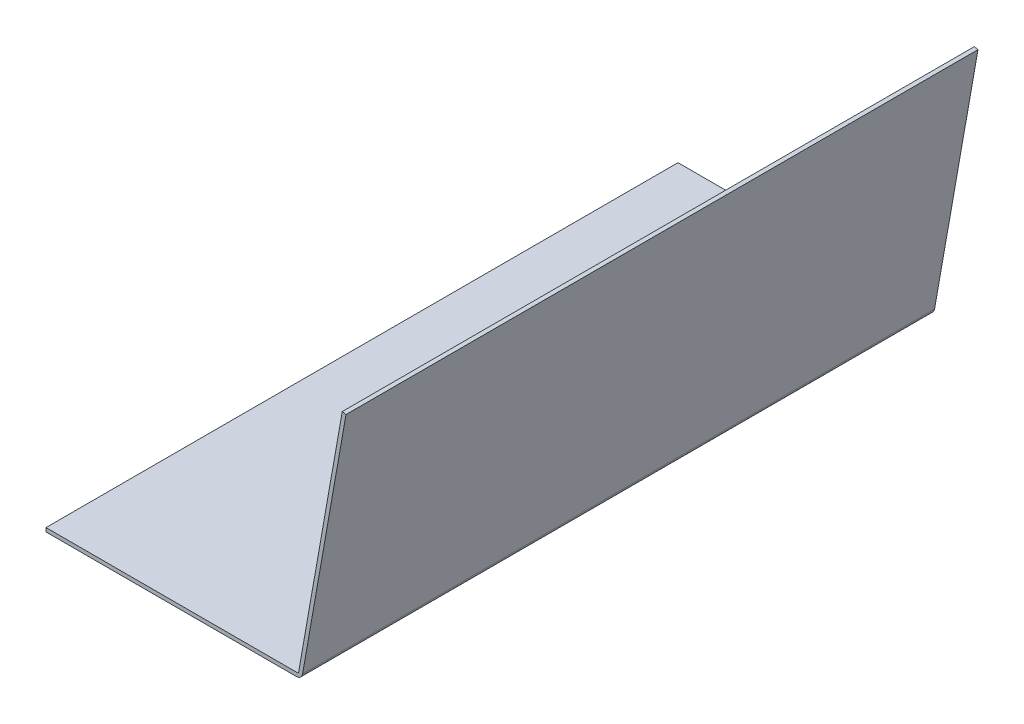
from build123d import *

# Parameters (mm, degrees)
EXTRU_MINCE1_DEPTH = 497
CONG_2_R           = 5


with BuildPart() as part:
    # Esquisse2 → Extru.-Mince1 (new body)
    with BuildSketch(Plane.XY):
        Polygon((-66.402829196, 0), (132.097170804, 0), (166.566334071, 195.484338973), (169.52075733, 194.96339444), (134.614469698, -3), (-66.402829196, -3), align=None)
    extrude(amount=EXTRU_MINCE1_DEPTH)

    # Cong_2
    cong_2_edges = [part.edges().sort_by_distance(p)[0] for p in [
        (134.614469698, -3, 248.5),
    ]]
    fillet(cong_2_edges, radius=CONG_2_R)


solid = part.part
